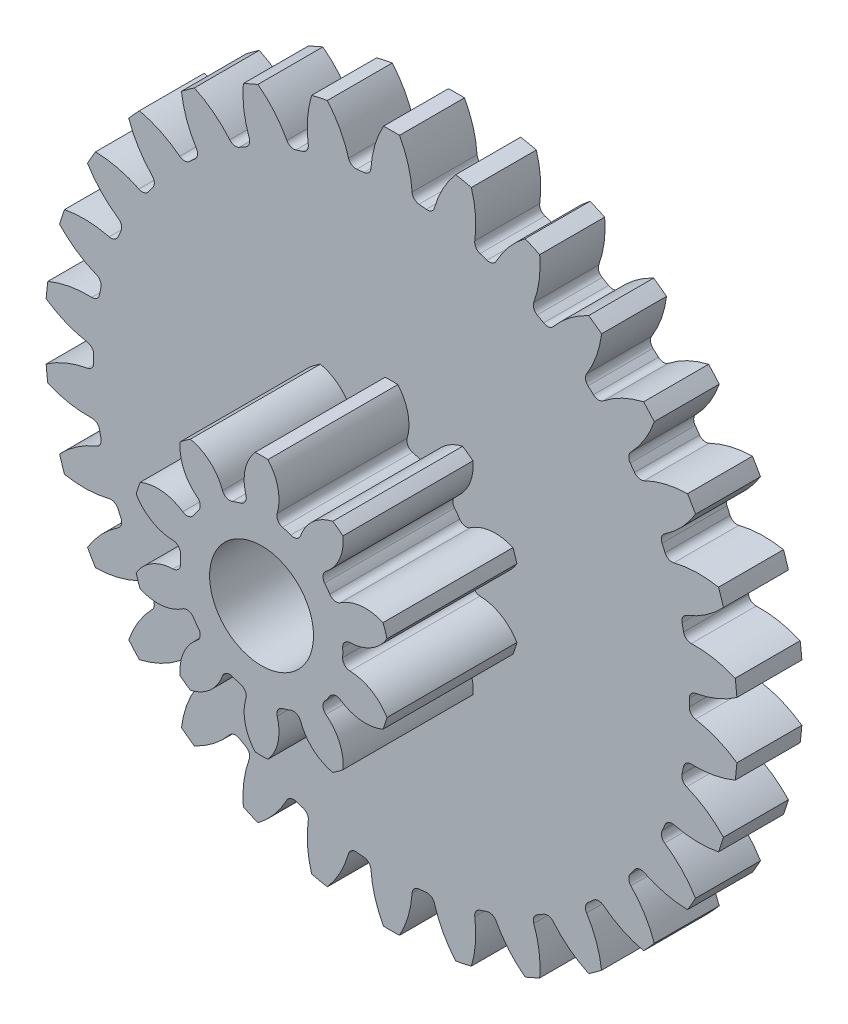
from build123d import *

# Parameters (mm, degrees)
BOSS_EXTRU_1_DEPTH                 = 1.5
CONG_1_R                           = 0.175
R_P_TITION_CIRCULAIRE4_COUNT       = 30
CONG_1_OF_R_P_TITION_CIRCULAIRE4_R = 0.175
BOSS_EXTRU_2_DEPTH                 = 3
CONG_2_R                           = 0.175
R_P_TITION_CIRCULAIRE5_COUNT       = 10
CONG_2_OF_R_P_TITION_CIRCULAIRE5_R = 0.175
ESQUISSE10_R                       = 1.2
ENL_V_MAT_EXTRU_4_DEPTH            = 14.45326172


with BuildPart() as part:
    # Esquisse3 → Boss.-Extru.1 (new body)
    with BuildSketch(Plane.XY):
        with BuildLine():
            Line((-2.097340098, 6.276985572), (-1.378706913, -0.560352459))
            Line((-1.378706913, -0.560352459), (-0.660073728, 6.276985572))
            ThreePointArc((-0.660073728, 6.276985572), (-0.778877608, 6.288430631), (-0.897862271, 6.29781154))
            ThreePointArc((-0.897862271, 6.29781154), (-0.974546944, 6.88628764), (-1.194373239, 7.437523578))
            ThreePointArc((-1.194373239, 7.437523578), (-1.378706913, 7.439647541), (-1.563040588, 7.437523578))
            ThreePointArc((-1.563040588, 7.437523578), (-1.782866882, 6.88628764), (-1.859551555, 6.29781154))
            ThreePointArc((-1.859551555, 6.29781154), (-1.978536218, 6.288430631), (-2.097340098, 6.276985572))
        make_face()
    boss_extru_1 = extrude(amount=BOSS_EXTRU_1_DEPTH)

    # Cong_1
    cong_1_edges = [part.edges().sort_by_distance(p)[0] for p in [
        (-1.859551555, 6.29781154, 0.75),
        (-0.897862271, 6.29781154, 0.75),
    ]]
    fillet(cong_1_edges, radius=CONG_1_R)

    # R_p_tition circulaire4: Boss.-Extru.1 ×30 about axis
    r_p_tition_circulaire4_axis = Axis((-1.378706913, -0.560352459, 0), (0, 0, 1))
    for i in range(1, R_P_TITION_CIRCULAIRE4_COUNT):
        add(boss_extru_1.rotate(r_p_tition_circulaire4_axis, i * 360 / R_P_TITION_CIRCULAIRE4_COUNT))

    # Cong_1 of R_p_tition circulaire4
    cong_1_of_r_p_tition_circulaire4_edges = [part.edges().sort_by_distance(p)[0] for p in [
        (-3.274936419, 6.047970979, 0.75),
        (-2.334262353, 6.247917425, 0.75),
        (-4.607446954, 5.509314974, 0.75),
        (-3.728900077, 5.900469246, 0.75),
        (-5.798846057, 4.705385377, 0.75),
        (-5.020823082, 5.270652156, 0.75),
        (-6.797063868, 3.671317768, 0.75),
        (-6.153568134, 4.385992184, 0.75),
        (-7.55847348, 2.452305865, 0.75),
        (-7.077628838, 3.285153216, 0.75),
        (-8.04979764, 1.101626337, 0.75),
        (-7.752619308, 2.016247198, 0.75),
        (-8.249563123, -0.32168964, 0.75),
        (-8.14903922, 0.63473141, 0.75),
        (-8.14903922, -1.755436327, 0.75),
        (-8.249563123, -0.799015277, 0.75),
        (-7.752619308, -3.136952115, 0.75),
        (-8.04979764, -2.222331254, 0.75),
        (-7.077628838, -4.405858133, 0.75),
        (-7.55847348, -3.573010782, 0.75),
        (-6.153568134, -5.506697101, 0.75),
        (-6.797063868, -4.792022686, 0.75),
        (-5.020823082, -6.391357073, 0.75),
        (-5.798846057, -5.826090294, 0.75),
        (-3.728900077, -7.021174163, 0.75),
        (-4.607446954, -6.630019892, 0.75),
        (-2.334262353, -7.368622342, 0.75),
        (-3.274936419, -7.168675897, 0.75),
        (-0.897862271, -7.418516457, 0.75),
        (-1.859551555, -7.418516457, 0.75),
        (0.517522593, -7.168675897, 0.75),
        (-0.423151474, -7.368622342, 0.75),
        (1.850033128, -6.630019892, 0.75),
        (0.97148625, -7.021174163, 0.75),
        (3.04143223, -5.826090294, 0.75),
        (2.263409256, -6.391357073, 0.75),
        (4.039650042, -4.792022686, 0.75),
        (3.396154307, -5.506697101, 0.75),
        (4.801059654, -3.573010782, 0.75),
        (4.320215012, -4.405858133, 0.75),
        (5.292383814, -2.222331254, 0.75),
        (4.995205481, -3.136952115, 0.75),
        (5.492149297, -0.799015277, 0.75),
        (5.391625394, -1.755436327, 0.75),
        (5.391625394, 0.63473141, 0.75),
        (5.492149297, -0.32168964, 0.75),
        (4.995205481, 2.016247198, 0.75),
        (5.292383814, 1.101626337, 0.75),
        (4.320215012, 3.285153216, 0.75),
        (4.801059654, 2.452305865, 0.75),
        (3.396154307, 4.385992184, 0.75),
        (4.039650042, 3.671317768, 0.75),
        (2.263409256, 5.270652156, 0.75),
        (3.04143223, 4.705385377, 0.75),
        (0.97148625, 5.900469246, 0.75),
        (1.850033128, 5.509314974, 0.75),
        (-0.423151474, 6.247917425, 0.75),
        (0.517522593, 6.047970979, 0.75),
    ]]
    fillet(cong_1_of_r_p_tition_circulaire4_edges, radius=CONG_1_OF_R_P_TITION_CIRCULAIRE4_R)

    # Esquisse8 → Boss.-Extru.2 (add)
    with BuildSketch(Plane.XY.offset(1.5)):
        with BuildLine():
            Line((-1.958113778, 1.222878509), (-1.378706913, -0.560352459))
            Line((-1.378706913, -0.560352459), (-0.799300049, 1.222878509))
            ThreePointArc((-0.799300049, 1.222878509), (-0.942925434, 1.263303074), (-1.089310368, 1.292179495))
            ThreePointArc((-1.089310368, 1.292179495), (-0.984517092, 1.886051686), (-1.231837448, 2.436050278))
            ThreePointArc((-1.231837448, 2.436050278), (-1.378706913, 2.439647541), (-1.525576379, 2.436050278))
            ThreePointArc((-1.525576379, 2.436050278), (-1.772896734, 1.886051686), (-1.668103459, 1.292179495))
            ThreePointArc((-1.668103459, 1.292179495), (-1.814488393, 1.263303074), (-1.958113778, 1.222878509))
        make_face()
    boss_extru_2 = extrude(amount=BOSS_EXTRU_2_DEPTH)

    # Cong_2
    cong_2_edges = [part.edges().sort_by_distance(p)[0] for p in [
        (-1.089310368, 1.292179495, 3),
        (-1.668103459, 1.292179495, 3),
    ]]
    fillet(cong_2_edges, radius=CONG_2_R)

    # R_p_tition circulaire5: Boss.-Extru.2 ×10 about axis
    r_p_tition_circulaire5_axis = Axis((-1.378706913, -0.560352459, 0), (0, 0, 1))
    for i in range(1, R_P_TITION_CIRCULAIRE5_COUNT):
        add(boss_extru_2.rotate(r_p_tition_circulaire5_axis, i * 360 / R_P_TITION_CIRCULAIRE5_COUNT))

    # Cong_2 of R_p_tition circulaire5
    cong_2_of_r_p_tition_circulaire5_edges = [part.edges().sort_by_distance(p)[0] for p in [
        (-2.233471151, 1.108480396, 3),
        (-2.701724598, 0.768274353, 3),
        (-3.051141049, 0.287343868, 3),
        (-3.22999795, -0.263121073, 3),
        (-3.22999795, -0.857583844, 3),
        (-3.051141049, -1.408048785, 3),
        (-2.701724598, -1.88897927, 3),
        (-2.233471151, -2.229185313, 3),
        (-1.668103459, -2.412884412, 3),
        (-1.089310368, -2.412884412, 3),
        (-0.523942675, -2.229185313, 3),
        (-0.055689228, -1.88897927, 3),
        (0.293727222, -1.408048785, 3),
        (0.472584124, -0.857583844, 3),
        (0.472584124, -0.263121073, 3),
        (0.293727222, 0.287343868, 3),
        (-0.055689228, 0.768274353, 3),
        (-0.523942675, 1.108480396, 3),
    ]]
    fillet(cong_2_of_r_p_tition_circulaire5_edges, radius=CONG_2_OF_R_P_TITION_CIRCULAIRE5_R)

    # Esquisse10 → Enl_v. mat.-Extru.4 (cut, through all)
    with BuildSketch(Plane.XY):
        with Locations((-1.378706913, -0.560352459)):
            Circle(ESQUISSE10_R)
    extrude(amount=ENL_V_MAT_EXTRU_4_DEPTH, mode=Mode.SUBTRACT)


solid = part.part
